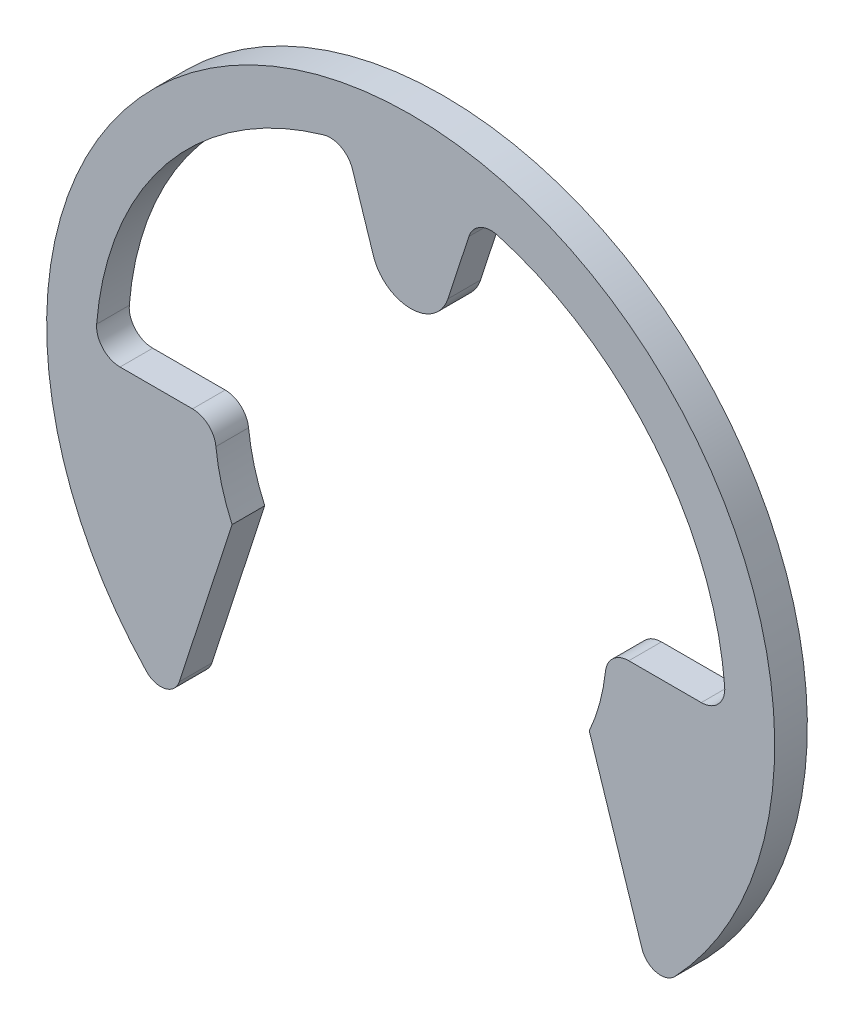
from build123d import *

# Parameters (mm, degrees)
BASEBODY_DEPTH = 2
FILLET1_R      = 1.44


with BuildPart() as part:
    # BodySke → BaseBody (new body)
    with BuildSketch(Plane.XY):
        with BuildLine():
            Line((10.94, -4.931166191), (14.174072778, -14.884618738))
            ThreePointArc((14.174072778, -14.884618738), (15.050904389, -15.684299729), (16.186355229, -15.339227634))
            ThreePointArc((16.186355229, -15.339227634), (0, 22.3), (-16.186355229, -15.339227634))
            ThreePointArc((-16.186355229, -15.339227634), (-15.050904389, -15.684299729), (-14.174072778, -14.884618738))
            Line((-14.174072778, -14.884618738), (-10.94, -4.931166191))
            ThreePointArc((-10.94, -4.931166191), (-11.732007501, -2.521904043), (-12, 0))
            Line((-12, 0), (-19.3, 0))
            ThreePointArc((-19.3, 0), (-14.988645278, 12.158557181), (-3.980775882, 18.885005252))
            Line((-3.980775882, 18.885005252), (-2.282535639, 13.658359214))
            ThreePointArc((-2.282535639, 13.658359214), (0, 12), (2.282535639, 13.658359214))
            Line((2.282535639, 13.658359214), (3.980775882, 18.885005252))
            ThreePointArc((3.980775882, 18.885005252), (14.988645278, 12.158557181), (19.3, 0))
            Line((19.3, 0), (12, 0))
            ThreePointArc((12, 0), (11.732007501, -2.521904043), (10.94, -4.931166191))
        make_face()
    extrude(amount=BASEBODY_DEPTH)

    # Fillet1
    fillet1_edges = [part.edges().sort_by_distance(p)[0] for p in [
        (12, 0, 1),
        (19.3, 0, 1),
        (3.980775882, 18.885005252, 1),
        (-3.980775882, 18.885005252, 1),
        (-19.3, 0, 1),
        (-12, 0, 1),
    ]]
    fillet(fillet1_edges, radius=FILLET1_R)


solid = part.part
